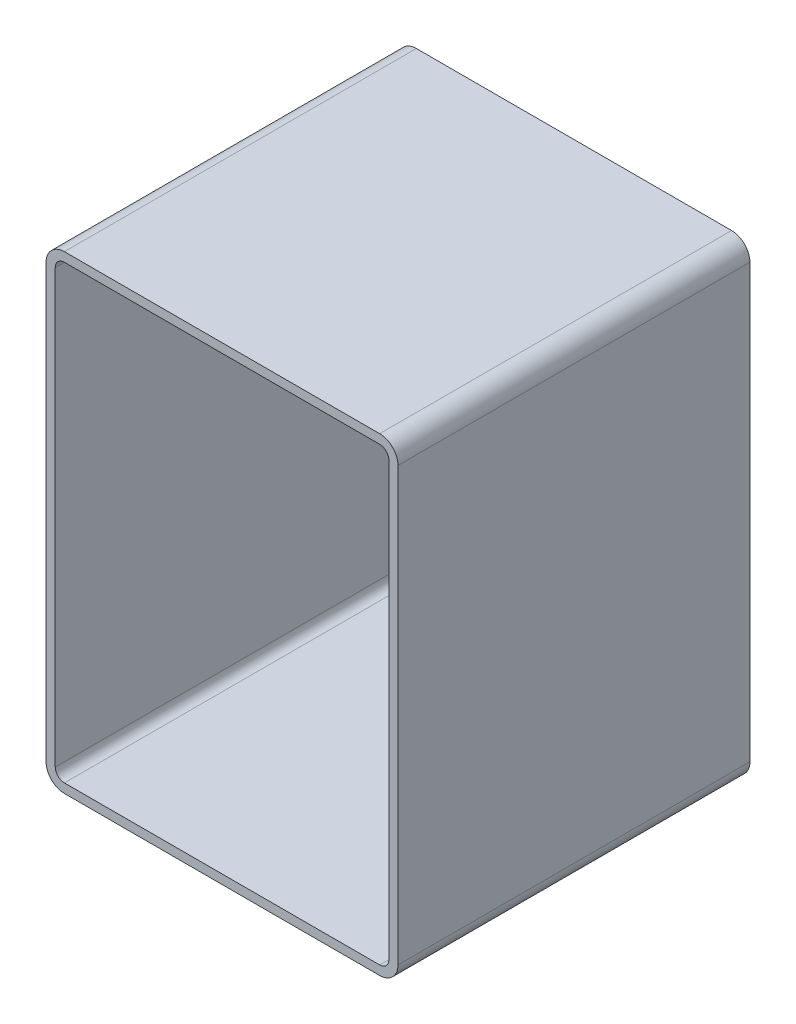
ISO-10303-21;
HEADER;
FILE_DESCRIPTION(('STEP AP214'),'2;1');
FILE_NAME('part.step','',(''),(''),'','','');
FILE_SCHEMA(('AUTOMOTIVE_DESIGN { 1 0 10303 214 1 1 1 1 }'));
ENDSEC;
DATA;
#1=APPLICATION_CONTEXT('core data for automotive mechanical design processes');
#2=APPLICATION_PROTOCOL_DEFINITION('international standard','automotive_design',2000,#1);
#3=PRODUCT_CONTEXT('',#1,'mechanical');
#4=PRODUCT('Part','Part','',(#3));
#5=PRODUCT_RELATED_PRODUCT_CATEGORY('part','',(#4));
#6=PRODUCT_DEFINITION_FORMATION('','',#4);
#7=PRODUCT_DEFINITION_CONTEXT('part definition',#1,'design');
#8=PRODUCT_DEFINITION('design','',#6,#7);
#9=PRODUCT_DEFINITION_SHAPE('','',#8);
#10=(LENGTH_UNIT() NAMED_UNIT(*) SI_UNIT(.MILLI.,.METRE.));
#11=(NAMED_UNIT(*) PLANE_ANGLE_UNIT() SI_UNIT($,.RADIAN.));
#12=(NAMED_UNIT(*) SI_UNIT($,.STERADIAN.) SOLID_ANGLE_UNIT());
#13=UNCERTAINTY_MEASURE_WITH_UNIT(LENGTH_MEASURE(1.E-05),#10,'distance_accuracy_value','');
#14=(GEOMETRIC_REPRESENTATION_CONTEXT(3) GLOBAL_UNCERTAINTY_ASSIGNED_CONTEXT((#13)) GLOBAL_UNIT_ASSIGNED_CONTEXT((#10,
#11,#12)) REPRESENTATION_CONTEXT('',''));
#15=CARTESIAN_POINT('',(0.,0.,0.));
#16=DIRECTION('',(0.,0.,1.));
#17=DIRECTION('',(1.,0.,0.));
#18=AXIS2_PLACEMENT_3D('',#15,#16,#17);
#19=CARTESIAN_POINT('',(16.9817030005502,392.30786249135,304.8));
#20=DIRECTION('',(0.,0.,1.));
#21=DIRECTION('',(1.,0.,0.));
#22=AXIS2_PLACEMENT_3D('',#19,#20,#21);
#23=PLANE('',#22);
#24=CARTESIAN_POINT('',(16.9817030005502,392.30786249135,304.8));
#25=DIRECTION('',(0.,0.,1.));
#26=DIRECTION('',(1.,0.,0.));
#27=AXIS2_PLACEMENT_3D('',#24,#25,#26);
#28=CIRCLE('',#27,15.875);
#29=CARTESIAN_POINT('',(16.9817030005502,408.18286249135,304.8));
#30=VERTEX_POINT('',#29);
#31=CARTESIAN_POINT('',(1.10670300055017,392.30786249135,304.8));
#32=VERTEX_POINT('',#31);
#33=EDGE_CURVE('E211',#30,#32,#28,.T.);
#34=ORIENTED_EDGE('',*,*,#33,.T.);
#35=DIRECTION('',(0.,-1.,0.));
#36=VECTOR('',#35,1.);
#37=CARTESIAN_POINT('',(1.10670300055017,17.6578624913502,304.8));
#38=LINE('',#37,#36);
#39=CARTESIAN_POINT('',(1.10670300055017,17.6578624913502,304.8));
#40=VERTEX_POINT('',#39);
#41=EDGE_CURVE('E214',#32,#40,#38,.T.);
#42=ORIENTED_EDGE('',*,*,#41,.T.);
#43=CARTESIAN_POINT('',(16.9817030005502,17.6578624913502,304.8));
#44=DIRECTION('',(0.,0.,1.));
#45=DIRECTION('',(1.,0.,0.));
#46=AXIS2_PLACEMENT_3D('',#43,#44,#45);
#47=CIRCLE('',#46,15.875);
#48=CARTESIAN_POINT('',(16.9817030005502,1.78286249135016,304.8));
#49=VERTEX_POINT('',#48);
#50=EDGE_CURVE('E217',#40,#49,#47,.T.);
#51=ORIENTED_EDGE('',*,*,#50,.T.);
#52=DIRECTION('',(1.,0.,0.));
#53=VECTOR('',#52,1.);
#54=CARTESIAN_POINT('',(290.03170300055,1.78286249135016,304.8));
#55=LINE('',#54,#53);
#56=CARTESIAN_POINT('',(290.03170300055,1.78286249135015,304.8));
#57=VERTEX_POINT('',#56);
#58=EDGE_CURVE('E219',#49,#57,#55,.T.);
#59=ORIENTED_EDGE('',*,*,#58,.T.);
#60=CARTESIAN_POINT('',(290.03170300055,17.6578624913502,304.8));
#61=DIRECTION('',(0.,0.,1.));
#62=DIRECTION('',(1.,0.,0.));
#63=AXIS2_PLACEMENT_3D('',#60,#61,#62);
#64=CIRCLE('',#63,15.875);
#65=CARTESIAN_POINT('',(305.90670300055,17.6578624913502,304.8));
#66=VERTEX_POINT('',#65);
#67=EDGE_CURVE('E221',#57,#66,#64,.T.);
#68=ORIENTED_EDGE('',*,*,#67,.T.);
#69=DIRECTION('',(0.,1.,0.));
#70=VECTOR('',#69,1.);
#71=CARTESIAN_POINT('',(305.90670300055,392.30786249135,304.8));
#72=LINE('',#71,#70);
#73=CARTESIAN_POINT('',(305.90670300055,392.30786249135,304.8));
#74=VERTEX_POINT('',#73);
#75=EDGE_CURVE('E223',#66,#74,#72,.T.);
#76=ORIENTED_EDGE('',*,*,#75,.T.);
#77=CARTESIAN_POINT('',(290.03170300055,392.30786249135,304.8));
#78=DIRECTION('',(0.,0.,1.));
#79=DIRECTION('',(1.,0.,0.));
#80=AXIS2_PLACEMENT_3D('',#77,#78,#79);
#81=CIRCLE('',#80,15.875);
#82=CARTESIAN_POINT('',(290.03170300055,408.18286249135,304.8));
#83=VERTEX_POINT('',#82);
#84=EDGE_CURVE('E225',#74,#83,#81,.T.);
#85=ORIENTED_EDGE('',*,*,#84,.T.);
#86=DIRECTION('',(-1.,0.,0.));
#87=VECTOR('',#86,1.);
#88=CARTESIAN_POINT('',(16.9817030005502,408.18286249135,304.8));
#89=LINE('',#88,#87);
#90=EDGE_CURVE('E227',#83,#30,#89,.T.);
#91=ORIENTED_EDGE('',*,*,#90,.T.);
#92=EDGE_LOOP('',(#34,#42,#51,#59,#68,#76,#85,#91));
#93=FACE_BOUND('',#92,.T.);
#94=DIRECTION('',(0.,-1.,0.));
#95=VECTOR('',#94,1.);
#96=CARTESIAN_POINT('',(9.04420300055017,17.6578624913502,304.8));
#97=LINE('',#96,#95);
#98=CARTESIAN_POINT('',(9.04420300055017,392.30786249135,304.8));
#99=VERTEX_POINT('',#98);
#100=CARTESIAN_POINT('',(9.04420300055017,17.6578624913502,304.8));
#101=VERTEX_POINT('',#100);
#102=EDGE_CURVE('E154',#99,#101,#97,.T.);
#103=ORIENTED_EDGE('',*,*,#102,.F.);
#104=CARTESIAN_POINT('',(16.9817030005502,392.30786249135,304.8));
#105=DIRECTION('',(0.,0.,1.));
#106=DIRECTION('',(1.,0.,0.));
#107=AXIS2_PLACEMENT_3D('',#104,#105,#106);
#108=CIRCLE('',#107,7.93750000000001);
#109=CARTESIAN_POINT('',(16.9817030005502,400.24536249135,304.8));
#110=VERTEX_POINT('',#109);
#111=EDGE_CURVE('E146',#110,#99,#108,.T.);
#112=ORIENTED_EDGE('',*,*,#111,.F.);
#113=DIRECTION('',(-1.,0.,0.));
#114=VECTOR('',#113,1.);
#115=CARTESIAN_POINT('',(16.9817030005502,400.24536249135,304.8));
#116=LINE('',#115,#114);
#117=CARTESIAN_POINT('',(290.03170300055,400.24536249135,304.8));
#118=VERTEX_POINT('',#117);
#119=EDGE_CURVE('E179',#118,#110,#116,.T.);
#120=ORIENTED_EDGE('',*,*,#119,.F.);
#121=CARTESIAN_POINT('',(290.03170300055,392.30786249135,304.8));
#122=DIRECTION('',(0.,0.,1.));
#123=DIRECTION('',(1.,0.,0.));
#124=AXIS2_PLACEMENT_3D('',#121,#122,#123);
#125=CIRCLE('',#124,7.93750000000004);
#126=CARTESIAN_POINT('',(297.96920300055,392.30786249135,304.8));
#127=VERTEX_POINT('',#126);
#128=EDGE_CURVE('E177',#127,#118,#125,.T.);
#129=ORIENTED_EDGE('',*,*,#128,.F.);
#130=DIRECTION('',(0.,1.,0.));
#131=VECTOR('',#130,1.);
#132=CARTESIAN_POINT('',(297.96920300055,392.30786249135,304.8));
#133=LINE('',#132,#131);
#134=CARTESIAN_POINT('',(297.96920300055,17.6578624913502,304.8));
#135=VERTEX_POINT('',#134);
#136=EDGE_CURVE('E175',#135,#127,#133,.T.);
#137=ORIENTED_EDGE('',*,*,#136,.F.);
#138=CARTESIAN_POINT('',(290.03170300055,17.6578624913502,304.8));
#139=DIRECTION('',(0.,0.,1.));
#140=DIRECTION('',(1.,0.,0.));
#141=AXIS2_PLACEMENT_3D('',#138,#139,#140);
#142=CIRCLE('',#141,7.93750000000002);
#143=CARTESIAN_POINT('',(290.03170300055,9.72036249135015,304.8));
#144=VERTEX_POINT('',#143);
#145=EDGE_CURVE('E173',#144,#135,#142,.T.);
#146=ORIENTED_EDGE('',*,*,#145,.F.);
#147=DIRECTION('',(1.,0.,0.));
#148=VECTOR('',#147,1.);
#149=CARTESIAN_POINT('',(290.03170300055,9.72036249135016,304.8));
#150=LINE('',#149,#148);
#151=CARTESIAN_POINT('',(16.9817030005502,9.72036249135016,304.8));
#152=VERTEX_POINT('',#151);
#153=EDGE_CURVE('E169',#152,#144,#150,.T.);
#154=ORIENTED_EDGE('',*,*,#153,.F.);
#155=CARTESIAN_POINT('',(16.9817030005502,17.6578624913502,304.8));
#156=DIRECTION('',(0.,0.,1.));
#157=DIRECTION('',(1.,0.,0.));
#158=AXIS2_PLACEMENT_3D('',#155,#156,#157);
#159=CIRCLE('',#158,7.9375);
#160=EDGE_CURVE('E167',#101,#152,#159,.T.);
#161=ORIENTED_EDGE('',*,*,#160,.F.);
#162=EDGE_LOOP('',(#103,#112,#120,#129,#137,#146,#154,#161));
#163=FACE_BOUND('',#162,.T.);
#164=ADVANCED_FACE('F33',(#93,#163),#23,.T.);
#165=CARTESIAN_POINT('',(16.9817030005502,392.30786249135,0.));
#166=DIRECTION('',(0.,0.,1.));
#167=DIRECTION('',(1.,0.,0.));
#168=AXIS2_PLACEMENT_3D('',#165,#166,#167);
#169=PLANE('',#168);
#170=CARTESIAN_POINT('',(16.9817030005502,392.30786249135,0.));
#171=DIRECTION('',(0.,0.,1.));
#172=DIRECTION('',(1.,0.,0.));
#173=AXIS2_PLACEMENT_3D('',#170,#171,#172);
#174=CIRCLE('',#173,15.875);
#175=CARTESIAN_POINT('',(16.9817030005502,408.18286249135,0.));
#176=VERTEX_POINT('',#175);
#177=CARTESIAN_POINT('',(1.10670300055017,392.30786249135,0.));
#178=VERTEX_POINT('',#177);
#179=EDGE_CURVE('E162',#176,#178,#174,.T.);
#180=ORIENTED_EDGE('',*,*,#179,.F.);
#181=DIRECTION('',(-1.,0.,0.));
#182=VECTOR('',#181,1.);
#183=CARTESIAN_POINT('',(16.9817030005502,408.18286249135,0.));
#184=LINE('',#183,#182);
#185=CARTESIAN_POINT('',(290.03170300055,408.18286249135,0.));
#186=VERTEX_POINT('',#185);
#187=EDGE_CURVE('E215',#186,#176,#184,.T.);
#188=ORIENTED_EDGE('',*,*,#187,.F.);
#189=CARTESIAN_POINT('',(290.03170300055,392.30786249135,0.));
#190=DIRECTION('',(0.,0.,1.));
#191=DIRECTION('',(1.,0.,0.));
#192=AXIS2_PLACEMENT_3D('',#189,#190,#191);
#193=CIRCLE('',#192,15.875);
#194=CARTESIAN_POINT('',(305.90670300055,392.30786249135,0.));
#195=VERTEX_POINT('',#194);
#196=EDGE_CURVE('E242',#195,#186,#193,.T.);
#197=ORIENTED_EDGE('',*,*,#196,.F.);
#198=DIRECTION('',(0.,1.,0.));
#199=VECTOR('',#198,1.);
#200=CARTESIAN_POINT('',(305.90670300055,392.30786249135,0.));
#201=LINE('',#200,#199);
#202=CARTESIAN_POINT('',(305.90670300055,17.6578624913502,0.));
#203=VERTEX_POINT('',#202);
#204=EDGE_CURVE('E240',#203,#195,#201,.T.);
#205=ORIENTED_EDGE('',*,*,#204,.F.);
#206=CARTESIAN_POINT('',(290.03170300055,17.6578624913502,0.));
#207=DIRECTION('',(0.,0.,1.));
#208=DIRECTION('',(1.,0.,0.));
#209=AXIS2_PLACEMENT_3D('',#206,#207,#208);
#210=CIRCLE('',#209,15.875);
#211=CARTESIAN_POINT('',(290.03170300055,1.78286249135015,0.));
#212=VERTEX_POINT('',#211);
#213=EDGE_CURVE('E238',#212,#203,#210,.T.);
#214=ORIENTED_EDGE('',*,*,#213,.F.);
#215=DIRECTION('',(1.,0.,0.));
#216=VECTOR('',#215,1.);
#217=CARTESIAN_POINT('',(290.03170300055,1.78286249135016,0.));
#218=LINE('',#217,#216);
#219=CARTESIAN_POINT('',(16.9817030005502,1.78286249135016,0.));
#220=VERTEX_POINT('',#219);
#221=EDGE_CURVE('E236',#220,#212,#218,.T.);
#222=ORIENTED_EDGE('',*,*,#221,.F.);
#223=CARTESIAN_POINT('',(16.9817030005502,17.6578624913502,0.));
#224=DIRECTION('',(0.,0.,1.));
#225=DIRECTION('',(1.,0.,0.));
#226=AXIS2_PLACEMENT_3D('',#223,#224,#225);
#227=CIRCLE('',#226,15.875);
#228=CARTESIAN_POINT('',(1.10670300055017,17.6578624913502,0.));
#229=VERTEX_POINT('',#228);
#230=EDGE_CURVE('E234',#229,#220,#227,.T.);
#231=ORIENTED_EDGE('',*,*,#230,.F.);
#232=DIRECTION('',(0.,-1.,0.));
#233=VECTOR('',#232,1.);
#234=CARTESIAN_POINT('',(1.10670300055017,17.6578624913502,0.));
#235=LINE('',#234,#233);
#236=EDGE_CURVE('E232',#178,#229,#235,.T.);
#237=ORIENTED_EDGE('',*,*,#236,.F.);
#238=EDGE_LOOP('',(#180,#188,#197,#205,#214,#222,#231,#237));
#239=FACE_BOUND('',#238,.T.);
#240=CARTESIAN_POINT('',(16.9817030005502,392.30786249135,0.));
#241=DIRECTION('',(0.,0.,1.));
#242=DIRECTION('',(1.,0.,0.));
#243=AXIS2_PLACEMENT_3D('',#240,#241,#242);
#244=CIRCLE('',#243,7.93750000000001);
#245=CARTESIAN_POINT('',(16.9817030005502,400.24536249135,0.));
#246=VERTEX_POINT('',#245);
#247=CARTESIAN_POINT('',(9.04420300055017,392.30786249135,0.));
#248=VERTEX_POINT('',#247);
#249=EDGE_CURVE('E56',#246,#248,#244,.T.);
#250=ORIENTED_EDGE('',*,*,#249,.T.);
#251=DIRECTION('',(0.,-1.,0.));
#252=VECTOR('',#251,1.);
#253=CARTESIAN_POINT('',(9.04420300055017,17.6578624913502,0.));
#254=LINE('',#253,#252);
#255=CARTESIAN_POINT('',(9.04420300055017,17.6578624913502,0.));
#256=VERTEX_POINT('',#255);
#257=EDGE_CURVE('E161',#248,#256,#254,.T.);
#258=ORIENTED_EDGE('',*,*,#257,.T.);
#259=CARTESIAN_POINT('',(16.9817030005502,17.6578624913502,0.));
#260=DIRECTION('',(0.,0.,1.));
#261=DIRECTION('',(1.,0.,0.));
#262=AXIS2_PLACEMENT_3D('',#259,#260,#261);
#263=CIRCLE('',#262,7.9375);
#264=CARTESIAN_POINT('',(16.9817030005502,9.72036249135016,0.));
#265=VERTEX_POINT('',#264);
#266=EDGE_CURVE('E183',#256,#265,#263,.T.);
#267=ORIENTED_EDGE('',*,*,#266,.T.);
#268=DIRECTION('',(1.,0.,0.));
#269=VECTOR('',#268,1.);
#270=CARTESIAN_POINT('',(290.03170300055,9.72036249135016,0.));
#271=LINE('',#270,#269);
#272=CARTESIAN_POINT('',(290.03170300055,9.72036249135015,0.));
#273=VERTEX_POINT('',#272);
#274=EDGE_CURVE('E186',#265,#273,#271,.T.);
#275=ORIENTED_EDGE('',*,*,#274,.T.);
#276=CARTESIAN_POINT('',(290.03170300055,17.6578624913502,0.));
#277=DIRECTION('',(0.,0.,1.));
#278=DIRECTION('',(1.,0.,0.));
#279=AXIS2_PLACEMENT_3D('',#276,#277,#278);
#280=CIRCLE('',#279,7.93750000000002);
#281=CARTESIAN_POINT('',(297.96920300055,17.6578624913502,0.));
#282=VERTEX_POINT('',#281);
#283=EDGE_CURVE('E189',#273,#282,#280,.T.);
#284=ORIENTED_EDGE('',*,*,#283,.T.);
#285=DIRECTION('',(0.,1.,0.));
#286=VECTOR('',#285,1.);
#287=CARTESIAN_POINT('',(297.96920300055,392.30786249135,0.));
#288=LINE('',#287,#286);
#289=CARTESIAN_POINT('',(297.96920300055,392.30786249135,0.));
#290=VERTEX_POINT('',#289);
#291=EDGE_CURVE('E192',#282,#290,#288,.T.);
#292=ORIENTED_EDGE('',*,*,#291,.T.);
#293=CARTESIAN_POINT('',(290.03170300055,392.30786249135,0.));
#294=DIRECTION('',(0.,0.,1.));
#295=DIRECTION('',(1.,0.,0.));
#296=AXIS2_PLACEMENT_3D('',#293,#294,#295);
#297=CIRCLE('',#296,7.93750000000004);
#298=CARTESIAN_POINT('',(290.03170300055,400.24536249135,0.));
#299=VERTEX_POINT('',#298);
#300=EDGE_CURVE('E195',#290,#299,#297,.T.);
#301=ORIENTED_EDGE('',*,*,#300,.T.);
#302=DIRECTION('',(-1.,0.,0.));
#303=VECTOR('',#302,1.);
#304=CARTESIAN_POINT('',(16.9817030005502,400.24536249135,0.));
#305=LINE('',#304,#303);
#306=EDGE_CURVE('E155',#299,#246,#305,.T.);
#307=ORIENTED_EDGE('',*,*,#306,.T.);
#308=EDGE_LOOP('',(#250,#258,#267,#275,#284,#292,#301,#307));
#309=FACE_BOUND('',#308,.T.);
#310=ADVANCED_FACE('F272',(#239,#309),#169,.F.);
#311=CARTESIAN_POINT('',(16.9817030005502,392.30786249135,304.8));
#312=DIRECTION('',(0.,0.,-1.));
#313=DIRECTION('',(-1.,0.,0.));
#314=AXIS2_PLACEMENT_3D('',#311,#312,#313);
#315=CYLINDRICAL_SURFACE('',#314,15.875);
#316=ORIENTED_EDGE('',*,*,#179,.T.);
#317=DIRECTION('',(0.,0.,-1.));
#318=VECTOR('',#317,1.);
#319=CARTESIAN_POINT('',(1.10670300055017,392.30786249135,304.8));
#320=LINE('',#319,#318);
#321=EDGE_CURVE('E11',#32,#178,#320,.T.);
#322=ORIENTED_EDGE('',*,*,#321,.F.);
#323=ORIENTED_EDGE('',*,*,#33,.F.);
#324=DIRECTION('',(0.,0.,-1.));
#325=VECTOR('',#324,1.);
#326=CARTESIAN_POINT('',(16.9817030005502,408.18286249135,304.8));
#327=LINE('',#326,#325);
#328=EDGE_CURVE('E229',#30,#176,#327,.T.);
#329=ORIENTED_EDGE('',*,*,#328,.T.);
#330=EDGE_LOOP('',(#316,#322,#323,#329));
#331=FACE_BOUND('',#330,.T.);
#332=ADVANCED_FACE('F35',(#331),#315,.T.);
#333=CARTESIAN_POINT('',(1.10670300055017,17.6578624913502,304.8));
#334=DIRECTION('',(1.,0.,0.));
#335=DIRECTION('',(0.,0.,-1.));
#336=AXIS2_PLACEMENT_3D('',#333,#334,#335);
#337=PLANE('',#336);
#338=ORIENTED_EDGE('',*,*,#236,.T.);
#339=DIRECTION('',(0.,0.,-1.));
#340=VECTOR('',#339,1.);
#341=CARTESIAN_POINT('',(1.10670300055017,17.6578624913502,304.8));
#342=LINE('',#341,#340);
#343=EDGE_CURVE('E41',#40,#229,#342,.T.);
#344=ORIENTED_EDGE('',*,*,#343,.F.);
#345=ORIENTED_EDGE('',*,*,#41,.F.);
#346=ORIENTED_EDGE('',*,*,#321,.T.);
#347=EDGE_LOOP('',(#338,#344,#345,#346));
#348=FACE_BOUND('',#347,.T.);
#349=ADVANCED_FACE('F289',(#348),#337,.F.);
#350=CARTESIAN_POINT('',(16.9817030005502,17.6578624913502,304.8));
#351=DIRECTION('',(0.,0.,-1.));
#352=DIRECTION('',(-1.,0.,0.));
#353=AXIS2_PLACEMENT_3D('',#350,#351,#352);
#354=CYLINDRICAL_SURFACE('',#353,15.875);
#355=ORIENTED_EDGE('',*,*,#230,.T.);
#356=DIRECTION('',(0.,0.,-1.));
#357=VECTOR('',#356,1.);
#358=CARTESIAN_POINT('',(16.9817030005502,1.78286249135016,304.8));
#359=LINE('',#358,#357);
#360=EDGE_CURVE('E259',#49,#220,#359,.T.);
#361=ORIENTED_EDGE('',*,*,#360,.F.);
#362=ORIENTED_EDGE('',*,*,#50,.F.);
#363=ORIENTED_EDGE('',*,*,#343,.T.);
#364=EDGE_LOOP('',(#355,#361,#362,#363));
#365=FACE_BOUND('',#364,.T.);
#366=ADVANCED_FACE('F266',(#365),#354,.T.);
#367=CARTESIAN_POINT('',(290.03170300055,1.78286249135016,304.8));
#368=DIRECTION('',(0.,1.,0.));
#369=DIRECTION('',(0.,0.,1.));
#370=AXIS2_PLACEMENT_3D('',#367,#368,#369);
#371=PLANE('',#370);
#372=ORIENTED_EDGE('',*,*,#221,.T.);
#373=DIRECTION('',(0.,0.,-1.));
#374=VECTOR('',#373,1.);
#375=CARTESIAN_POINT('',(290.03170300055,1.78286249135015,304.8));
#376=LINE('',#375,#374);
#377=EDGE_CURVE('E256',#57,#212,#376,.T.);
#378=ORIENTED_EDGE('',*,*,#377,.F.);
#379=ORIENTED_EDGE('',*,*,#58,.F.);
#380=ORIENTED_EDGE('',*,*,#360,.T.);
#381=EDGE_LOOP('',(#372,#378,#379,#380));
#382=FACE_BOUND('',#381,.T.);
#383=ADVANCED_FACE('F278',(#382),#371,.F.);
#384=CARTESIAN_POINT('',(290.03170300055,17.6578624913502,304.8));
#385=DIRECTION('',(0.,0.,-1.));
#386=DIRECTION('',(-1.,0.,0.));
#387=AXIS2_PLACEMENT_3D('',#384,#385,#386);
#388=CYLINDRICAL_SURFACE('',#387,15.875);
#389=ORIENTED_EDGE('',*,*,#213,.T.);
#390=DIRECTION('',(0.,0.,-1.));
#391=VECTOR('',#390,1.);
#392=CARTESIAN_POINT('',(305.90670300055,17.6578624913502,304.8));
#393=LINE('',#392,#391);
#394=EDGE_CURVE('E253',#66,#203,#393,.T.);
#395=ORIENTED_EDGE('',*,*,#394,.F.);
#396=ORIENTED_EDGE('',*,*,#67,.F.);
#397=ORIENTED_EDGE('',*,*,#377,.T.);
#398=EDGE_LOOP('',(#389,#395,#396,#397));
#399=FACE_BOUND('',#398,.T.);
#400=ADVANCED_FACE('F282',(#399),#388,.T.);
#401=CARTESIAN_POINT('',(305.90670300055,392.30786249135,304.8));
#402=DIRECTION('',(-1.,0.,0.));
#403=DIRECTION('',(0.,0.,1.));
#404=AXIS2_PLACEMENT_3D('',#401,#402,#403);
#405=PLANE('',#404);
#406=ORIENTED_EDGE('',*,*,#204,.T.);
#407=DIRECTION('',(0.,0.,-1.));
#408=VECTOR('',#407,1.);
#409=CARTESIAN_POINT('',(305.90670300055,392.30786249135,304.8));
#410=LINE('',#409,#408);
#411=EDGE_CURVE('E250',#74,#195,#410,.T.);
#412=ORIENTED_EDGE('',*,*,#411,.F.);
#413=ORIENTED_EDGE('',*,*,#75,.F.);
#414=ORIENTED_EDGE('',*,*,#394,.T.);
#415=EDGE_LOOP('',(#406,#412,#413,#414));
#416=FACE_BOUND('',#415,.T.);
#417=ADVANCED_FACE('F302',(#416),#405,.F.);
#418=CARTESIAN_POINT('',(290.03170300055,392.30786249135,304.8));
#419=DIRECTION('',(0.,0.,-1.));
#420=DIRECTION('',(-1.,0.,0.));
#421=AXIS2_PLACEMENT_3D('',#418,#419,#420);
#422=CYLINDRICAL_SURFACE('',#421,15.875);
#423=ORIENTED_EDGE('',*,*,#196,.T.);
#424=DIRECTION('',(0.,0.,-1.));
#425=VECTOR('',#424,1.);
#426=CARTESIAN_POINT('',(290.03170300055,408.18286249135,304.8));
#427=LINE('',#426,#425);
#428=EDGE_CURVE('E247',#83,#186,#427,.T.);
#429=ORIENTED_EDGE('',*,*,#428,.F.);
#430=ORIENTED_EDGE('',*,*,#84,.F.);
#431=ORIENTED_EDGE('',*,*,#411,.T.);
#432=EDGE_LOOP('',(#423,#429,#430,#431));
#433=FACE_BOUND('',#432,.T.);
#434=ADVANCED_FACE('F300',(#433),#422,.T.);
#435=CARTESIAN_POINT('',(16.9817030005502,408.18286249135,304.8));
#436=DIRECTION('',(0.,-1.,0.));
#437=DIRECTION('',(0.,0.,-1.));
#438=AXIS2_PLACEMENT_3D('',#435,#436,#437);
#439=PLANE('',#438);
#440=ORIENTED_EDGE('',*,*,#187,.T.);
#441=ORIENTED_EDGE('',*,*,#328,.F.);
#442=ORIENTED_EDGE('',*,*,#90,.F.);
#443=ORIENTED_EDGE('',*,*,#428,.T.);
#444=EDGE_LOOP('',(#440,#441,#442,#443));
#445=FACE_BOUND('',#444,.T.);
#446=ADVANCED_FACE('F295',(#445),#439,.F.);
#447=CARTESIAN_POINT('',(16.9817030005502,392.30786249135,304.8));
#448=DIRECTION('',(0.,0.,-1.));
#449=DIRECTION('',(-1.,0.,0.));
#450=AXIS2_PLACEMENT_3D('',#447,#448,#449);
#451=CYLINDRICAL_SURFACE('',#450,7.93750000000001);
#452=ORIENTED_EDGE('',*,*,#249,.F.);
#453=DIRECTION('',(0.,0.,-1.));
#454=VECTOR('',#453,1.);
#455=CARTESIAN_POINT('',(16.9817030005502,400.24536249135,304.8));
#456=LINE('',#455,#454);
#457=EDGE_CURVE('E150',#110,#246,#456,.T.);
#458=ORIENTED_EDGE('',*,*,#457,.F.);
#459=ORIENTED_EDGE('',*,*,#111,.T.);
#460=DIRECTION('',(0.,0.,-1.));
#461=VECTOR('',#460,1.);
#462=CARTESIAN_POINT('',(9.04420300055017,392.30786249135,304.8));
#463=LINE('',#462,#461);
#464=EDGE_CURVE('E149',#99,#248,#463,.T.);
#465=ORIENTED_EDGE('',*,*,#464,.T.);
#466=EDGE_LOOP('',(#452,#458,#459,#465));
#467=FACE_BOUND('',#466,.T.);
#468=ADVANCED_FACE('F148',(#467),#451,.F.);
#469=CARTESIAN_POINT('',(9.04420300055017,17.6578624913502,304.8));
#470=DIRECTION('',(1.,0.,0.));
#471=DIRECTION('',(0.,0.,-1.));
#472=AXIS2_PLACEMENT_3D('',#469,#470,#471);
#473=PLANE('',#472);
#474=ORIENTED_EDGE('',*,*,#257,.F.);
#475=ORIENTED_EDGE('',*,*,#464,.F.);
#476=ORIENTED_EDGE('',*,*,#102,.T.);
#477=DIRECTION('',(0.,0.,-1.));
#478=VECTOR('',#477,1.);
#479=CARTESIAN_POINT('',(9.04420300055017,17.6578624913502,304.8));
#480=LINE('',#479,#478);
#481=EDGE_CURVE('E163',#101,#256,#480,.T.);
#482=ORIENTED_EDGE('',*,*,#481,.T.);
#483=EDGE_LOOP('',(#474,#475,#476,#482));
#484=FACE_BOUND('',#483,.T.);
#485=ADVANCED_FACE('F158',(#484),#473,.T.);
#486=CARTESIAN_POINT('',(16.9817030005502,17.6578624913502,304.8));
#487=DIRECTION('',(0.,0.,-1.));
#488=DIRECTION('',(-1.,0.,0.));
#489=AXIS2_PLACEMENT_3D('',#486,#487,#488);
#490=CYLINDRICAL_SURFACE('',#489,7.9375);
#491=ORIENTED_EDGE('',*,*,#266,.F.);
#492=ORIENTED_EDGE('',*,*,#481,.F.);
#493=ORIENTED_EDGE('',*,*,#160,.T.);
#494=DIRECTION('',(0.,0.,-1.));
#495=VECTOR('',#494,1.);
#496=CARTESIAN_POINT('',(16.9817030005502,9.72036249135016,304.8));
#497=LINE('',#496,#495);
#498=EDGE_CURVE('E208',#152,#265,#497,.T.);
#499=ORIENTED_EDGE('',*,*,#498,.T.);
#500=EDGE_LOOP('',(#491,#492,#493,#499));
#501=FACE_BOUND('',#500,.T.);
#502=ADVANCED_FACE('F327',(#501),#490,.F.);
#503=CARTESIAN_POINT('',(290.03170300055,9.72036249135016,304.8));
#504=DIRECTION('',(0.,1.,0.));
#505=DIRECTION('',(0.,0.,1.));
#506=AXIS2_PLACEMENT_3D('',#503,#504,#505);
#507=PLANE('',#506);
#508=ORIENTED_EDGE('',*,*,#274,.F.);
#509=ORIENTED_EDGE('',*,*,#498,.F.);
#510=ORIENTED_EDGE('',*,*,#153,.T.);
#511=DIRECTION('',(0.,0.,-1.));
#512=VECTOR('',#511,1.);
#513=CARTESIAN_POINT('',(290.03170300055,9.72036249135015,304.8));
#514=LINE('',#513,#512);
#515=EDGE_CURVE('E206',#144,#273,#514,.T.);
#516=ORIENTED_EDGE('',*,*,#515,.T.);
#517=EDGE_LOOP('',(#508,#509,#510,#516));
#518=FACE_BOUND('',#517,.T.);
#519=ADVANCED_FACE('F331',(#518),#507,.T.);
#520=CARTESIAN_POINT('',(290.03170300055,17.6578624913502,304.8));
#521=DIRECTION('',(0.,0.,-1.));
#522=DIRECTION('',(-1.,0.,0.));
#523=AXIS2_PLACEMENT_3D('',#520,#521,#522);
#524=CYLINDRICAL_SURFACE('',#523,7.93750000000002);
#525=ORIENTED_EDGE('',*,*,#283,.F.);
#526=ORIENTED_EDGE('',*,*,#515,.F.);
#527=ORIENTED_EDGE('',*,*,#145,.T.);
#528=DIRECTION('',(0.,0.,-1.));
#529=VECTOR('',#528,1.);
#530=CARTESIAN_POINT('',(297.96920300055,17.6578624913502,304.8));
#531=LINE('',#530,#529);
#532=EDGE_CURVE('E204',#135,#282,#531,.T.);
#533=ORIENTED_EDGE('',*,*,#532,.T.);
#534=EDGE_LOOP('',(#525,#526,#527,#533));
#535=FACE_BOUND('',#534,.T.);
#536=ADVANCED_FACE('F337',(#535),#524,.F.);
#537=CARTESIAN_POINT('',(297.96920300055,392.30786249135,304.8));
#538=DIRECTION('',(-1.,0.,0.));
#539=DIRECTION('',(0.,0.,1.));
#540=AXIS2_PLACEMENT_3D('',#537,#538,#539);
#541=PLANE('',#540);
#542=ORIENTED_EDGE('',*,*,#291,.F.);
#543=ORIENTED_EDGE('',*,*,#532,.F.);
#544=ORIENTED_EDGE('',*,*,#136,.T.);
#545=DIRECTION('',(0.,0.,-1.));
#546=VECTOR('',#545,1.);
#547=CARTESIAN_POINT('',(297.96920300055,392.30786249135,304.8));
#548=LINE('',#547,#546);
#549=EDGE_CURVE('E202',#127,#290,#548,.T.);
#550=ORIENTED_EDGE('',*,*,#549,.T.);
#551=EDGE_LOOP('',(#542,#543,#544,#550));
#552=FACE_BOUND('',#551,.T.);
#553=ADVANCED_FACE('F341',(#552),#541,.T.);
#554=CARTESIAN_POINT('',(290.03170300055,392.30786249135,304.8));
#555=DIRECTION('',(0.,0.,-1.));
#556=DIRECTION('',(-1.,0.,0.));
#557=AXIS2_PLACEMENT_3D('',#554,#555,#556);
#558=CYLINDRICAL_SURFACE('',#557,7.93750000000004);
#559=ORIENTED_EDGE('',*,*,#300,.F.);
#560=ORIENTED_EDGE('',*,*,#549,.F.);
#561=ORIENTED_EDGE('',*,*,#128,.T.);
#562=DIRECTION('',(0.,0.,-1.));
#563=VECTOR('',#562,1.);
#564=CARTESIAN_POINT('',(290.03170300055,400.24536249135,304.8));
#565=LINE('',#564,#563);
#566=EDGE_CURVE('E48',#118,#299,#565,.T.);
#567=ORIENTED_EDGE('',*,*,#566,.T.);
#568=EDGE_LOOP('',(#559,#560,#561,#567));
#569=FACE_BOUND('',#568,.T.);
#570=ADVANCED_FACE('F345',(#569),#558,.F.);
#571=CARTESIAN_POINT('',(16.9817030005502,400.24536249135,304.8));
#572=DIRECTION('',(0.,-1.,0.));
#573=DIRECTION('',(0.,0.,-1.));
#574=AXIS2_PLACEMENT_3D('',#571,#572,#573);
#575=PLANE('',#574);
#576=ORIENTED_EDGE('',*,*,#306,.F.);
#577=ORIENTED_EDGE('',*,*,#566,.F.);
#578=ORIENTED_EDGE('',*,*,#119,.T.);
#579=ORIENTED_EDGE('',*,*,#457,.T.);
#580=EDGE_LOOP('',(#576,#577,#578,#579));
#581=FACE_BOUND('',#580,.T.);
#582=ADVANCED_FACE('F349',(#581),#575,.T.);
#583=CLOSED_SHELL('',(#164,#310,#332,#349,#366,#383,#400,#417,#434,#446,#468,#485,#502,#519,
#536,#553,#570,#582));
#584=MANIFOLD_SOLID_BREP('B2',#583);
#585=ADVANCED_BREP_SHAPE_REPRESENTATION('',(#18,#584),#14);
#586=SHAPE_DEFINITION_REPRESENTATION(#9,#585);
ENDSEC;
END-ISO-10303-21;
